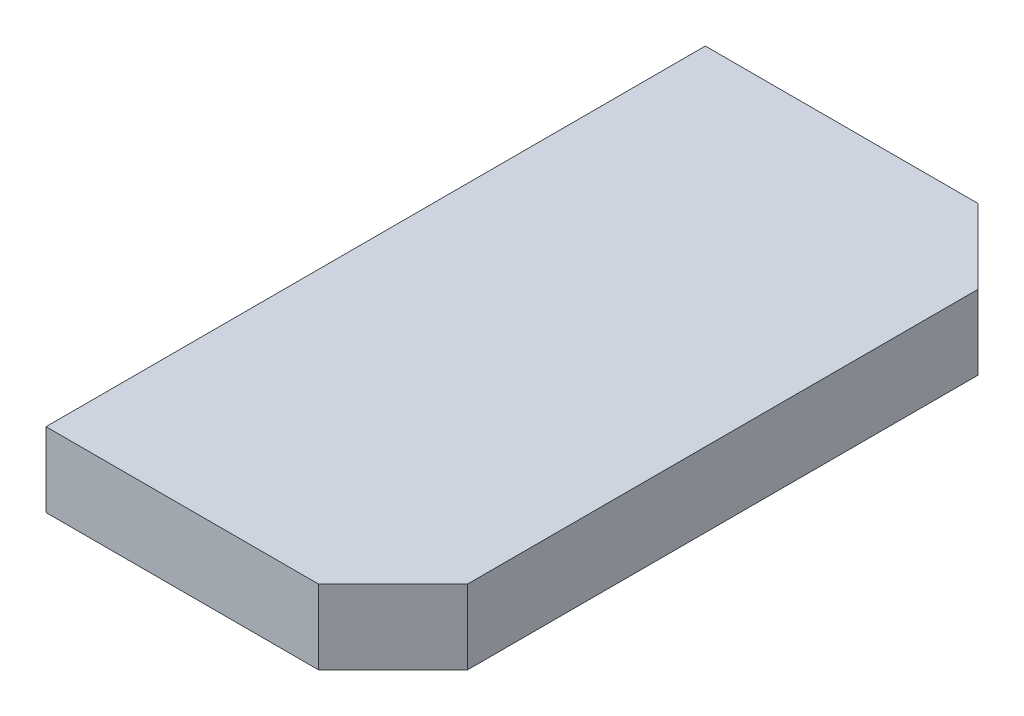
from build123d import *

# Parameters (mm, degrees)
ESQUISSE1_W      = 70
ESQUISSE1_H      = 15
EXTRUSION1_DEPTH = 133
CHANFREIN1_SIZE  = 15


with BuildPart() as part:
    # Esquisse1 → Extrusion1 (new body)
    with BuildSketch(Plane.XY):
        with Locations((35, 7.5)):
            Rectangle(ESQUISSE1_W, ESQUISSE1_H)
    extrude(amount=EXTRUSION1_DEPTH)

    # Chanfrein1
    chanfrein1_edges = [part.edges().sort_by_distance(p)[0] for p in [
        (70, 7.5, 133),
        (70, 7.5, 0),
    ]]
    chamfer(chanfrein1_edges, length=CHANFREIN1_SIZE)


solid = part.part
